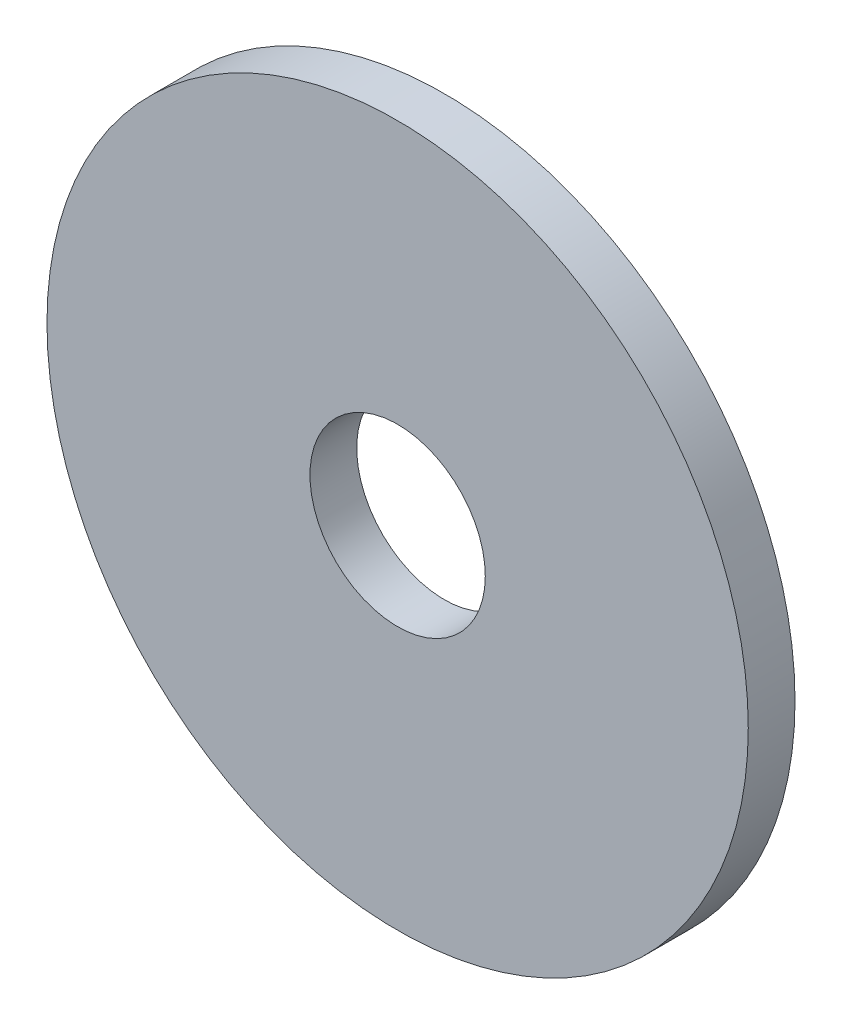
from build123d import *

# Parameters (mm, degrees)
SKETCH2_R           = 7.5
SKETCH2_R_2         = 1.875
BOSS_EXTRUDE1_DEPTH = 1


with BuildPart() as part:
    # Sketch2 → Boss-Extrude1 (new body)
    with BuildSketch(Plane.XY):
        Circle(SKETCH2_R)
        Circle(SKETCH2_R_2, mode=Mode.SUBTRACT)
    extrude(amount=BOSS_EXTRUDE1_DEPTH)


solid = part.part
